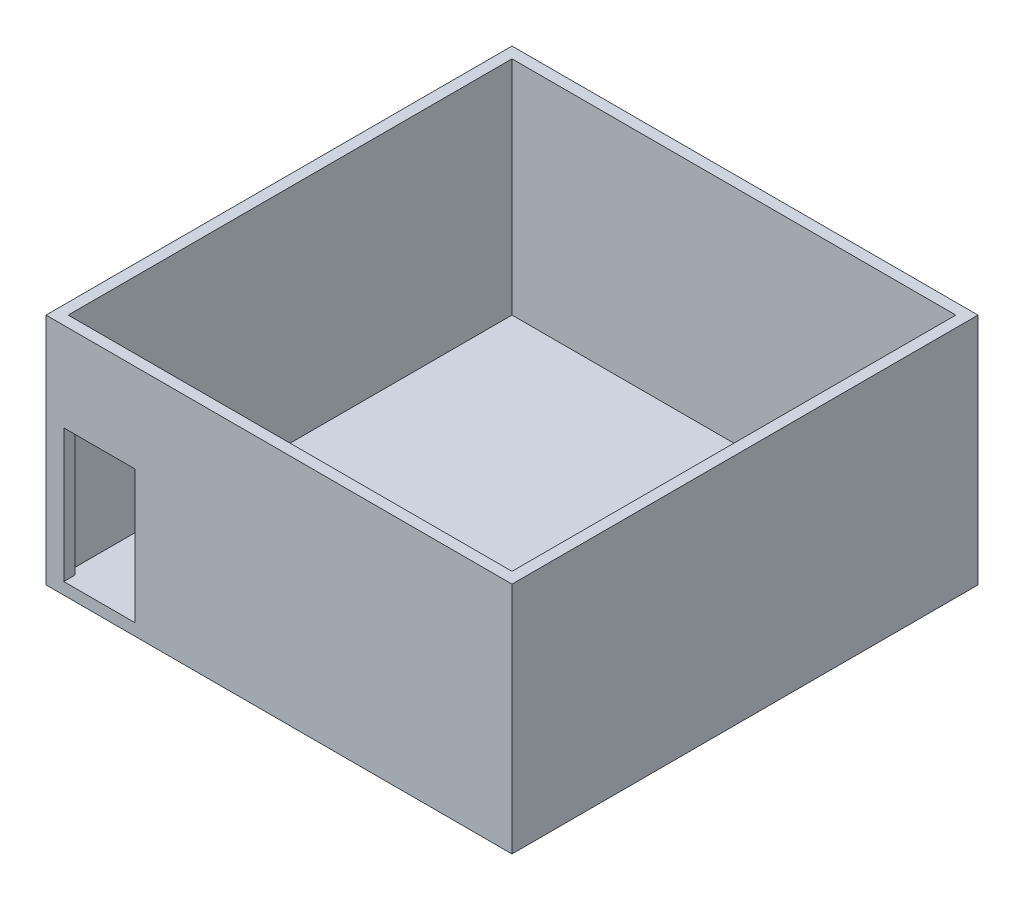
from build123d import *

# Parameters (mm, degrees)
SKIZZE1_W                       = 10500
SKIZZE1_H                       = 10500
SKIZZE1_W_2                     = 10000
SKIZZE1_H_2                     = 10000
LINEAR_AUSTRAGEN1_DEPTH         = 5000
SKIZZE2_W                       = 10500
SKIZZE2_H                       = 265.654648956
LINEAR_AUSTRAGEN2_DEPTH         = 10500
SCHNITT_LINEAR_AUSTRAGEN1_REACH = 15504.016
SKIZZE3_W                       = 1600
SKIZZE3_H                       = 3000


with BuildPart() as part:
    # Skizze1 → Linear austragen1 (new body)
    with BuildSketch(Plane(origin=(0, 0, 0), x_dir=(1, 0, 0), z_dir=(0, 1, 0))):
        with Locations((-5000, 5000)):
            Rectangle(SKIZZE1_W, SKIZZE1_H)
        with Locations((-5000, 5000)):
            Rectangle(SKIZZE1_W_2, SKIZZE1_H_2, mode=Mode.SUBTRACT)
    extrude(amount=LINEAR_AUSTRAGEN1_DEPTH)

    # Skizze2 → Linear austragen2 (add)
    with BuildSketch(Plane.XY.offset(250)):
        with Locations((-5000, -132.827324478)):
            Rectangle(SKIZZE2_W, SKIZZE2_H)
    extrude(amount=-LINEAR_AUSTRAGEN2_DEPTH)

    # Skizze3 → Schnitt-Linear austragen1 (cut, up to next)
    with BuildSketch(Plane.XY.offset(250), mode=Mode.PRIVATE) as schnitt_linear_austragen1_sk1:
        with Locations((-9050, 1500)):
            Rectangle(SKIZZE3_W, SKIZZE3_H)
    schnitt_linear_austragen1_tool1 = extrude(schnitt_linear_austragen1_sk1.sketch, amount=-SCHNITT_LINEAR_AUSTRAGEN1_REACH, mode=Mode.PRIVATE) & part.part
    add(schnitt_linear_austragen1_tool1.solids().sort_by_distance((-9050, 1500, 250))[0], mode=Mode.SUBTRACT)


solid = part.part
